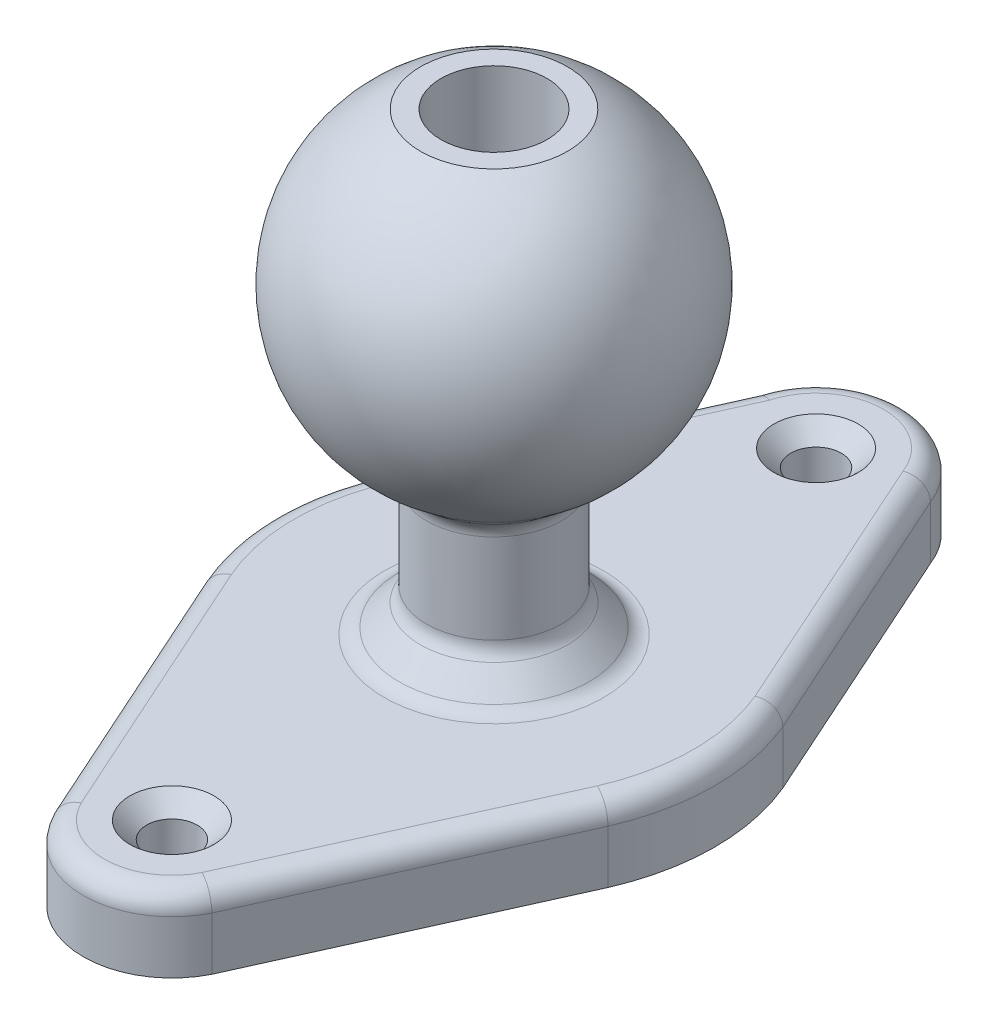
ISO-10303-21;
HEADER;
FILE_DESCRIPTION(('STEP AP214'),'2;1');
FILE_NAME('part.step','',(''),(''),'','','');
FILE_SCHEMA(('AUTOMOTIVE_DESIGN { 1 0 10303 214 1 1 1 1 }'));
ENDSEC;
DATA;
#1=APPLICATION_CONTEXT('core data for automotive mechanical design processes');
#2=APPLICATION_PROTOCOL_DEFINITION('international standard','automotive_design',2000,#1);
#3=PRODUCT_CONTEXT('',#1,'mechanical');
#4=PRODUCT('Part','Part','',(#3));
#5=PRODUCT_RELATED_PRODUCT_CATEGORY('part','',(#4));
#6=PRODUCT_DEFINITION_FORMATION('','',#4);
#7=PRODUCT_DEFINITION_CONTEXT('part definition',#1,'design');
#8=PRODUCT_DEFINITION('design','',#6,#7);
#9=PRODUCT_DEFINITION_SHAPE('','',#8);
#10=(LENGTH_UNIT() NAMED_UNIT(*) SI_UNIT(.MILLI.,.METRE.));
#11=(NAMED_UNIT(*) PLANE_ANGLE_UNIT() SI_UNIT($,.RADIAN.));
#12=(NAMED_UNIT(*) SI_UNIT($,.STERADIAN.) SOLID_ANGLE_UNIT());
#13=UNCERTAINTY_MEASURE_WITH_UNIT(LENGTH_MEASURE(1.E-05),#10,'distance_accuracy_value','');
#14=(GEOMETRIC_REPRESENTATION_CONTEXT(3) GLOBAL_UNCERTAINTY_ASSIGNED_CONTEXT((#13)) GLOBAL_UNIT_ASSIGNED_CONTEXT((#10,
#11,#12)) REPRESENTATION_CONTEXT('',''));
#15=CARTESIAN_POINT('',(0.,0.,0.));
#16=DIRECTION('',(0.,0.,1.));
#17=DIRECTION('',(1.,0.,0.));
#18=AXIS2_PLACEMENT_3D('',#15,#16,#17);
#19=CARTESIAN_POINT('',(0.,28.448,0.));
#20=DIRECTION('',(-0.683628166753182,0.,0.729830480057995));
#21=DIRECTION('',(-0.729830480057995,0.,-0.683628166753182));
#22=AXIS2_PLACEMENT_3D('',#19,#20,#21);
#23=SPHERICAL_SURFACE('',#22,12.7);
#24=CARTESIAN_POINT('',(0.,28.448,0.));
#25=DIRECTION('',(0.,1.,0.));
#26=DIRECTION('',(0.,0.,1.));
#27=AXIS2_PLACEMENT_3D('',#24,#25,#26);
#28=SPHERICAL_SURFACE('',#27,12.7);
#29=CARTESIAN_POINT('',(0.,18.1591898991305,0.));
#30=DIRECTION('',(0.,1.,0.));
#31=DIRECTION('',(0.,0.,1.));
#32=AXIS2_PLACEMENT_3D('',#29,#30,#31);
#33=CIRCLE('',#32,7.44515860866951);
#34=CARTESIAN_POINT('',(0.,18.1591898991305,7.44515860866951));
#35=VERTEX_POINT('',#34);
#36=EDGE_CURVE('E136',#35,#35,#33,.T.);
#37=ORIENTED_EDGE('',*,*,#36,.T.);
#38=EDGE_LOOP('',(#37));
#39=FACE_BOUND('',#38,.T.);
#40=CARTESIAN_POINT('',(0.,39.878,0.));
#41=DIRECTION('',(0.,1.,0.));
#42=DIRECTION('',(0.,0.,1.));
#43=AXIS2_PLACEMENT_3D('',#40,#41,#42);
#44=CIRCLE('',#43,5.53580165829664);
#45=CARTESIAN_POINT('',(0.,39.878,5.53580165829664));
#46=VERTEX_POINT('',#45);
#47=EDGE_CURVE('E247',#46,#46,#44,.F.);
#48=ORIENTED_EDGE('',*,*,#47,.T.);
#49=EDGE_LOOP('',(#48));
#50=FACE_BOUND('',#49,.T.);
#51=ADVANCED_FACE('F35',(#39,#50),#28,.T.);
#52=CARTESIAN_POINT('',(0.,5.588,0.));
#53=DIRECTION('',(0.,-1.,0.));
#54=DIRECTION('',(0.,0.,-1.));
#55=AXIS2_PLACEMENT_3D('',#52,#53,#54);
#56=PLANE('',#55);
#57=CARTESIAN_POINT('',(0.,5.588,-24.2824));
#58=DIRECTION('',(0.,-1.,0.));
#59=DIRECTION('',(0.,0.,-1.));
#60=AXIS2_PLACEMENT_3D('',#57,#58,#59);
#61=CIRCLE('',#60,3.17500000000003);
#62=CARTESIAN_POINT('',(0.,5.588,-27.4574));
#63=VERTEX_POINT('',#62);
#64=EDGE_CURVE('E43',#63,#63,#61,.T.);
#65=ORIENTED_EDGE('',*,*,#64,.T.);
#66=EDGE_LOOP('',(#65));
#67=FACE_BOUND('',#66,.T.);
#68=CARTESIAN_POINT('',(0.,5.588,24.2824));
#69=DIRECTION('',(0.,-1.,0.));
#70=DIRECTION('',(0.,0.,-1.));
#71=AXIS2_PLACEMENT_3D('',#68,#69,#70);
#72=CIRCLE('',#71,3.175);
#73=CARTESIAN_POINT('',(0.,5.588,21.1074));
#74=VERTEX_POINT('',#73);
#75=EDGE_CURVE('E678',#74,#74,#72,.T.);
#76=ORIENTED_EDGE('',*,*,#75,.T.);
#77=EDGE_LOOP('',(#76));
#78=FACE_BOUND('',#77,.T.);
#79=CARTESIAN_POINT('',(0.,5.588,0.));
#80=DIRECTION('',(0.,-1.,0.));
#81=DIRECTION('',(0.,0.,-1.));
#82=AXIS2_PLACEMENT_3D('',#79,#80,#81);
#83=CIRCLE('',#82,8.2775640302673);
#84=CARTESIAN_POINT('',(0.,5.588,-8.2775640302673));
#85=VERTEX_POINT('',#84);
#86=EDGE_CURVE('E218',#85,#85,#83,.T.);
#87=ORIENTED_EDGE('',*,*,#86,.T.);
#88=EDGE_LOOP('',(#87));
#89=FACE_BOUND('',#88,.T.);
#90=DIRECTION('',(0.410204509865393,0.,0.911993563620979));
#91=VECTOR('',#90,1.);
#92=CARTESIAN_POINT('',(-13.7241133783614,5.588,6.17295277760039));
#93=LINE('',#92,#91);
#94=CARTESIAN_POINT('',(-13.7961229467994,5.588,6.01285638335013));
#95=VERTEX_POINT('',#94);
#96=CARTESIAN_POINT('',(-4.54766749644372,5.588,26.5746289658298));
#97=VERTEX_POINT('',#96);
#98=EDGE_CURVE('E213',#95,#97,#93,.T.);
#99=ORIENTED_EDGE('',*,*,#98,.T.);
#100=CARTESIAN_POINT('',(0.,5.588,24.2824));
#101=DIRECTION('',(0.,-1.,0.));
#102=DIRECTION('',(0.,0.,-1.));
#103=AXIS2_PLACEMENT_3D('',#100,#101,#102);
#104=CIRCLE('',#103,5.0927);
#105=CARTESIAN_POINT('',(4.5476674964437,5.588,26.5746289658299));
#106=VERTEX_POINT('',#105);
#107=EDGE_CURVE('E215',#97,#106,#104,.F.);
#108=ORIENTED_EDGE('',*,*,#107,.T.);
#109=DIRECTION('',(0.410204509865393,0.,-0.911993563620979));
#110=VECTOR('',#109,1.);
#111=CARTESIAN_POINT('',(13.7241133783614,5.588,6.17295277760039));
#112=LINE('',#111,#110);
#113=CARTESIAN_POINT('',(13.7961229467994,5.588,6.01285638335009));
#114=VERTEX_POINT('',#113);
#115=EDGE_CURVE('E201',#106,#114,#112,.T.);
#116=ORIENTED_EDGE('',*,*,#115,.T.);
#117=CARTESIAN_POINT('',(0.,5.588,0.));
#118=DIRECTION('',(0.,-1.,0.));
#119=DIRECTION('',(0.,0.,-1.));
#120=AXIS2_PLACEMENT_3D('',#117,#118,#119);
#121=CIRCLE('',#120,15.0495);
#122=CARTESIAN_POINT('',(13.88885436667,5.588,-5.79544429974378));
#123=VERTEX_POINT('',#122);
#124=EDGE_CURVE('E203',#114,#123,#121,.F.);
#125=ORIENTED_EDGE('',*,*,#124,.T.);
#126=DIRECTION('',(-0.410259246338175,0.,-0.911968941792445));
#127=VECTOR('',#126,1.);
#128=CARTESIAN_POINT('',(13.7195134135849,5.588,-6.17187381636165));
#129=LINE('',#128,#127);
#130=CARTESIAN_POINT('',(4.77128554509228,5.588,-26.0629694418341));
#131=VERTEX_POINT('',#130);
#132=EDGE_CURVE('E205',#123,#131,#129,.T.);
#133=ORIENTED_EDGE('',*,*,#132,.T.);
#134=CARTESIAN_POINT('',(0.,5.588,-24.2824));
#135=DIRECTION('',(0.,-1.,0.));
#136=DIRECTION('',(0.,0.,-1.));
#137=AXIS2_PLACEMENT_3D('',#134,#135,#136);
#138=CIRCLE('',#137,5.0927);
#139=CARTESIAN_POINT('',(-4.90563269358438,5.588,-25.6500114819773));
#140=VERTEX_POINT('',#139);
#141=EDGE_CURVE('E207',#131,#140,#138,.F.);
#142=ORIENTED_EDGE('',*,*,#141,.T.);
#143=DIRECTION('',(-0.410204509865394,0.,0.911993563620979));
#144=VECTOR('',#143,1.);
#145=CARTESIAN_POINT('',(-13.6759415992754,5.588,-6.15128564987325));
#146=LINE('',#145,#144);
#147=CARTESIAN_POINT('',(-14.1976850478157,5.588,-4.99131140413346));
#148=VERTEX_POINT('',#147);
#149=EDGE_CURVE('E209',#140,#148,#146,.T.);
#150=ORIENTED_EDGE('',*,*,#149,.T.);
#151=CARTESIAN_POINT('',(0.,5.588,0.));
#152=DIRECTION('',(0.,-1.,0.));
#153=DIRECTION('',(0.,0.,-1.));
#154=AXIS2_PLACEMENT_3D('',#151,#152,#153);
#155=CIRCLE('',#154,15.0495);
#156=EDGE_CURVE('E211',#148,#95,#155,.F.);
#157=ORIENTED_EDGE('',*,*,#156,.T.);
#158=EDGE_LOOP('',(#99,#108,#116,#125,#133,#142,#150,#157));
#159=FACE_BOUND('',#158,.T.);
#160=ADVANCED_FACE('F336',(#67,#78,#89,#159),#56,.F.);
#161=CARTESIAN_POINT('',(0.,0.,0.));
#162=DIRECTION('',(0.,-1.,0.));
#163=DIRECTION('',(0.,0.,-1.));
#164=AXIS2_PLACEMENT_3D('',#161,#162,#163);
#165=PLANE('',#164);
#166=CARTESIAN_POINT('',(0.,0.,0.));
#167=DIRECTION('',(0.,-1.,0.));
#168=DIRECTION('',(0.,0.,-1.));
#169=AXIS2_PLACEMENT_3D('',#166,#167,#168);
#170=CIRCLE('',#169,1.74999999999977);
#171=CARTESIAN_POINT('',(0.,0.,-1.74999999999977));
#172=VERTEX_POINT('',#171);
#173=EDGE_CURVE('E632',#172,#172,#170,.T.);
#174=ORIENTED_EDGE('',*,*,#173,.F.);
#175=EDGE_LOOP('',(#174));
#176=FACE_BOUND('',#175,.T.);
#177=CARTESIAN_POINT('',(0.,0.,-24.2824));
#178=DIRECTION('',(0.,1.,0.));
#179=DIRECTION('',(0.,0.,1.));
#180=AXIS2_PLACEMENT_3D('',#177,#178,#179);
#181=CIRCLE('',#180,1.905);
#182=CARTESIAN_POINT('',(0.,0.,-22.3774));
#183=VERTEX_POINT('',#182);
#184=EDGE_CURVE('E153',#183,#183,#181,.T.);
#185=ORIENTED_EDGE('',*,*,#184,.T.);
#186=EDGE_LOOP('',(#185));
#187=FACE_BOUND('',#186,.T.);
#188=CARTESIAN_POINT('',(0.,0.,0.));
#189=DIRECTION('',(0.,1.,0.));
#190=DIRECTION('',(0.,0.,-1.));
#191=AXIS2_PLACEMENT_3D('',#188,#189,#190);
#192=CIRCLE('',#191,16.637);
#193=CARTESIAN_POINT('',(-15.6723500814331,0.,-5.58276024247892));
#194=VERTEX_POINT('',#193);
#195=CARTESIAN_POINT('',(-15.2476156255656,0.,6.65582352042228));
#196=VERTEX_POINT('',#195);
#197=EDGE_CURVE('E144',#194,#196,#192,.T.);
#198=ORIENTED_EDGE('',*,*,#197,.F.);
#199=DIRECTION('',(-0.410204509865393,0.,0.911993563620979));
#200=VECTOR('',#199,1.);
#201=CARTESIAN_POINT('',(-6.39926693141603,0.,-26.1992867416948));
#202=LINE('',#201,#200);
#203=CARTESIAN_POINT('',(-6.39926693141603,0.,-26.1992867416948));
#204=VERTEX_POINT('',#203);
#205=EDGE_CURVE('E173',#204,#194,#202,.T.);
#206=ORIENTED_EDGE('',*,*,#205,.F.);
#207=CARTESIAN_POINT('',(0.,0.,-24.2824));
#208=DIRECTION('',(0.,1.,0.));
#209=DIRECTION('',(0.,0.,1.));
#210=AXIS2_PLACEMENT_3D('',#207,#208,#209);
#211=CIRCLE('',#210,6.6802);
#212=CARTESIAN_POINT('',(6.23894528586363,0.,-26.67));
#213=VERTEX_POINT('',#212);
#214=EDGE_CURVE('E170',#213,#204,#211,.T.);
#215=ORIENTED_EDGE('',*,*,#214,.F.);
#216=DIRECTION('',(-0.410259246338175,0.,-0.911968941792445));
#217=VECTOR('',#216,1.);
#218=CARTESIAN_POINT('',(6.23894528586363,0.,-26.67));
#219=LINE('',#218,#217);
#220=CARTESIAN_POINT('',(15.345314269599,0.,-6.42737107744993));
#221=VERTEX_POINT('',#220);
#222=EDGE_CURVE('E167',#221,#213,#219,.T.);
#223=ORIENTED_EDGE('',*,*,#222,.F.);
#224=CARTESIAN_POINT('',(0.,0.,0.));
#225=DIRECTION('',(0.,1.,0.));
#226=DIRECTION('',(0.,0.,1.));
#227=AXIS2_PLACEMENT_3D('',#224,#225,#226);
#228=CIRCLE('',#227,16.637);
#229=CARTESIAN_POINT('',(15.2476156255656,0.,6.65582352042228));
#230=VERTEX_POINT('',#229);
#231=EDGE_CURVE('E164',#230,#221,#228,.T.);
#232=ORIENTED_EDGE('',*,*,#231,.F.);
#233=DIRECTION('',(0.410204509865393,0.,-0.911993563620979));
#234=VECTOR('',#233,1.);
#235=CARTESIAN_POINT('',(5.98203873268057,0.,27.2556616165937));
#236=LINE('',#235,#234);
#237=CARTESIAN_POINT('',(5.98203873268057,0.,27.2556616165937));
#238=VERTEX_POINT('',#237);
#239=EDGE_CURVE('E161',#238,#230,#236,.T.);
#240=ORIENTED_EDGE('',*,*,#239,.F.);
#241=CARTESIAN_POINT('',(0.,0.,24.2824));
#242=DIRECTION('',(0.,1.,0.));
#243=DIRECTION('',(0.,0.,1.));
#244=AXIS2_PLACEMENT_3D('',#241,#242,#243);
#245=CIRCLE('',#244,6.6802);
#246=CARTESIAN_POINT('',(-5.98203873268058,0.,27.2556616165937));
#247=VERTEX_POINT('',#246);
#248=EDGE_CURVE('E147',#247,#238,#245,.T.);
#249=ORIENTED_EDGE('',*,*,#248,.F.);
#250=DIRECTION('',(0.410204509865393,0.,0.911993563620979));
#251=VECTOR('',#250,1.);
#252=CARTESIAN_POINT('',(-15.2476156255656,0.,6.65582352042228));
#253=LINE('',#252,#251);
#254=EDGE_CURVE('E129',#196,#247,#253,.T.);
#255=ORIENTED_EDGE('',*,*,#254,.F.);
#256=EDGE_LOOP('',(#198,#206,#215,#223,#232,#240,#249,#255));
#257=FACE_BOUND('',#256,.T.);
#258=CARTESIAN_POINT('',(0.,0.,24.2824));
#259=DIRECTION('',(0.,1.,0.));
#260=DIRECTION('',(0.,0.,1.));
#261=AXIS2_PLACEMENT_3D('',#258,#259,#260);
#262=CIRCLE('',#261,1.905);
#263=CARTESIAN_POINT('',(0.,0.,26.1874));
#264=VERTEX_POINT('',#263);
#265=EDGE_CURVE('E156',#264,#264,#262,.T.);
#266=ORIENTED_EDGE('',*,*,#265,.T.);
#267=EDGE_LOOP('',(#266));
#268=FACE_BOUND('',#267,.T.);
#269=ADVANCED_FACE('F141',(#176,#187,#257,#268),#165,.T.);
#270=CARTESIAN_POINT('',(0.,5.588,0.));
#271=DIRECTION('',(0.,-1.,0.));
#272=DIRECTION('',(0.,0.,-1.));
#273=AXIS2_PLACEMENT_3D('',#270,#271,#272);
#274=CYLINDRICAL_SURFACE('',#273,16.637);
#275=DIRECTION('',(0.,-1.,0.));
#276=VECTOR('',#275,1.);
#277=CARTESIAN_POINT('',(-15.2476156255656,5.588,6.65582352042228));
#278=LINE('',#277,#276);
#279=CARTESIAN_POINT('',(-15.2476156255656,4.0005,6.65582352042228));
#280=VERTEX_POINT('',#279);
#281=EDGE_CURVE('E125',#280,#196,#278,.T.);
#282=ORIENTED_EDGE('',*,*,#281,.F.);
#283=CARTESIAN_POINT('',(0.,4.0005,0.));
#284=DIRECTION('',(0.,-1.,0.));
#285=DIRECTION('',(0.,0.,-1.));
#286=AXIS2_PLACEMENT_3D('',#283,#284,#285);
#287=CIRCLE('',#286,16.637);
#288=CARTESIAN_POINT('',(-15.6723500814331,4.0005,-5.58276024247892));
#289=VERTEX_POINT('',#288);
#290=EDGE_CURVE('E228',#280,#289,#287,.T.);
#291=ORIENTED_EDGE('',*,*,#290,.T.);
#292=DIRECTION('',(0.,-1.,0.));
#293=VECTOR('',#292,1.);
#294=CARTESIAN_POINT('',(-15.6723500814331,5.588,-5.58276024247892));
#295=LINE('',#294,#293);
#296=EDGE_CURVE('E151',#289,#194,#295,.T.);
#297=ORIENTED_EDGE('',*,*,#296,.T.);
#298=ORIENTED_EDGE('',*,*,#197,.T.);
#299=EDGE_LOOP('',(#282,#291,#297,#298));
#300=FACE_BOUND('',#299,.T.);
#301=ADVANCED_FACE('F149',(#300),#274,.T.);
#302=CARTESIAN_POINT('',(-15.2476156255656,5.588,6.65582352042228));
#303=DIRECTION('',(0.911993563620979,0.,-0.410204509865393));
#304=DIRECTION('',(-0.410204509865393,0.,-0.911993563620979));
#305=AXIS2_PLACEMENT_3D('',#302,#303,#304);
#306=PLANE('',#305);
#307=DIRECTION('',(0.,-1.,0.));
#308=VECTOR('',#307,1.);
#309=CARTESIAN_POINT('',(-5.98203873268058,5.588,27.2556616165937));
#310=LINE('',#309,#308);
#311=CARTESIAN_POINT('',(-5.98203873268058,4.0005,27.2556616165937));
#312=VERTEX_POINT('',#311);
#313=EDGE_CURVE('E137',#312,#247,#310,.T.);
#314=ORIENTED_EDGE('',*,*,#313,.F.);
#315=DIRECTION('',(0.410204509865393,0.,0.911993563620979));
#316=VECTOR('',#315,1.);
#317=CARTESIAN_POINT('',(-15.2476156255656,4.0005,6.65582352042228));
#318=LINE('',#317,#316);
#319=EDGE_CURVE('E132',#312,#280,#318,.F.);
#320=ORIENTED_EDGE('',*,*,#319,.T.);
#321=ORIENTED_EDGE('',*,*,#281,.T.);
#322=ORIENTED_EDGE('',*,*,#254,.T.);
#323=EDGE_LOOP('',(#314,#320,#321,#322));
#324=FACE_BOUND('',#323,.T.);
#325=ADVANCED_FACE('F128',(#324),#306,.F.);
#326=CARTESIAN_POINT('',(0.,5.588,24.2824));
#327=DIRECTION('',(0.,-1.,0.));
#328=DIRECTION('',(0.,0.,-1.));
#329=AXIS2_PLACEMENT_3D('',#326,#327,#328);
#330=CYLINDRICAL_SURFACE('',#329,6.6802);
#331=DIRECTION('',(0.,-1.,0.));
#332=VECTOR('',#331,1.);
#333=CARTESIAN_POINT('',(5.98203873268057,5.588,27.2556616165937));
#334=LINE('',#333,#332);
#335=CARTESIAN_POINT('',(5.98203873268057,4.0005,27.2556616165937));
#336=VERTEX_POINT('',#335);
#337=EDGE_CURVE('E184',#336,#238,#334,.T.);
#338=ORIENTED_EDGE('',*,*,#337,.F.);
#339=CARTESIAN_POINT('',(0.,4.0005,24.2824));
#340=DIRECTION('',(0.,-1.,0.));
#341=DIRECTION('',(0.,0.,-1.));
#342=AXIS2_PLACEMENT_3D('',#339,#340,#341);
#343=CIRCLE('',#342,6.6802);
#344=EDGE_CURVE('E224',#336,#312,#343,.T.);
#345=ORIENTED_EDGE('',*,*,#344,.T.);
#346=ORIENTED_EDGE('',*,*,#313,.T.);
#347=ORIENTED_EDGE('',*,*,#248,.T.);
#348=EDGE_LOOP('',(#338,#345,#346,#347));
#349=FACE_BOUND('',#348,.T.);
#350=ADVANCED_FACE('F382',(#349),#330,.T.);
#351=CARTESIAN_POINT('',(5.98203873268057,5.588,27.2556616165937));
#352=DIRECTION('',(-0.911993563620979,0.,-0.410204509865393));
#353=DIRECTION('',(-0.410204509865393,0.,0.911993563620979));
#354=AXIS2_PLACEMENT_3D('',#351,#352,#353);
#355=PLANE('',#354);
#356=DIRECTION('',(0.,-1.,0.));
#357=VECTOR('',#356,1.);
#358=CARTESIAN_POINT('',(15.2476156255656,5.588,6.65582352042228));
#359=LINE('',#358,#357);
#360=CARTESIAN_POINT('',(15.2476156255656,4.0005,6.65582352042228));
#361=VERTEX_POINT('',#360);
#362=EDGE_CURVE('E182',#361,#230,#359,.T.);
#363=ORIENTED_EDGE('',*,*,#362,.F.);
#364=DIRECTION('',(0.410204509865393,0.,-0.911993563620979));
#365=VECTOR('',#364,1.);
#366=CARTESIAN_POINT('',(5.98203873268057,4.0005,27.2556616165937));
#367=LINE('',#366,#365);
#368=EDGE_CURVE('E236',#361,#336,#367,.F.);
#369=ORIENTED_EDGE('',*,*,#368,.T.);
#370=ORIENTED_EDGE('',*,*,#337,.T.);
#371=ORIENTED_EDGE('',*,*,#239,.T.);
#372=EDGE_LOOP('',(#363,#369,#370,#371));
#373=FACE_BOUND('',#372,.T.);
#374=ADVANCED_FACE('F379',(#373),#355,.F.);
#375=CARTESIAN_POINT('',(0.,5.588,0.));
#376=DIRECTION('',(0.,-1.,0.));
#377=DIRECTION('',(0.,0.,-1.));
#378=AXIS2_PLACEMENT_3D('',#375,#376,#377);
#379=CYLINDRICAL_SURFACE('',#378,16.637);
#380=DIRECTION('',(0.,-1.,0.));
#381=VECTOR('',#380,1.);
#382=CARTESIAN_POINT('',(15.345314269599,5.588,-6.42737107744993));
#383=LINE('',#382,#381);
#384=CARTESIAN_POINT('',(15.345314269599,4.0005,-6.42737107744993));
#385=VERTEX_POINT('',#384);
#386=EDGE_CURVE('E180',#385,#221,#383,.T.);
#387=ORIENTED_EDGE('',*,*,#386,.F.);
#388=CARTESIAN_POINT('',(0.,4.0005,0.));
#389=DIRECTION('',(0.,-1.,0.));
#390=DIRECTION('',(0.,0.,-1.));
#391=AXIS2_PLACEMENT_3D('',#388,#389,#390);
#392=CIRCLE('',#391,16.637);
#393=EDGE_CURVE('E50',#385,#361,#392,.T.);
#394=ORIENTED_EDGE('',*,*,#393,.T.);
#395=ORIENTED_EDGE('',*,*,#362,.T.);
#396=ORIENTED_EDGE('',*,*,#231,.T.);
#397=EDGE_LOOP('',(#387,#394,#395,#396));
#398=FACE_BOUND('',#397,.T.);
#399=ADVANCED_FACE('F376',(#398),#379,.T.);
#400=CARTESIAN_POINT('',(6.23894528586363,5.588,-26.67));
#401=DIRECTION('',(-0.911968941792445,0.,0.410259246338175));
#402=DIRECTION('',(0.410259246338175,0.,0.911968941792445));
#403=AXIS2_PLACEMENT_3D('',#400,#401,#402);
#404=PLANE('',#403);
#405=DIRECTION('',(0.,-1.,0.));
#406=VECTOR('',#405,1.);
#407=CARTESIAN_POINT('',(6.23894528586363,5.588,-26.67));
#408=LINE('',#407,#406);
#409=CARTESIAN_POINT('',(6.23894528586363,4.0005,-26.67));
#410=VERTEX_POINT('',#409);
#411=EDGE_CURVE('E178',#410,#213,#408,.T.);
#412=ORIENTED_EDGE('',*,*,#411,.F.);
#413=DIRECTION('',(-0.410259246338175,0.,-0.911968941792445));
#414=VECTOR('',#413,1.);
#415=CARTESIAN_POINT('',(6.23894528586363,4.0005,-26.67));
#416=LINE('',#415,#414);
#417=EDGE_CURVE('E58',#410,#385,#416,.F.);
#418=ORIENTED_EDGE('',*,*,#417,.T.);
#419=ORIENTED_EDGE('',*,*,#386,.T.);
#420=ORIENTED_EDGE('',*,*,#222,.T.);
#421=EDGE_LOOP('',(#412,#418,#419,#420));
#422=FACE_BOUND('',#421,.T.);
#423=ADVANCED_FACE('F372',(#422),#404,.F.);
#424=CARTESIAN_POINT('',(0.,5.588,-24.2824));
#425=DIRECTION('',(0.,-1.,0.));
#426=DIRECTION('',(0.,0.,-1.));
#427=AXIS2_PLACEMENT_3D('',#424,#425,#426);
#428=CYLINDRICAL_SURFACE('',#427,6.6802);
#429=DIRECTION('',(0.,-1.,0.));
#430=VECTOR('',#429,1.);
#431=CARTESIAN_POINT('',(-6.39926693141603,5.588,-26.1992867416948));
#432=LINE('',#431,#430);
#433=CARTESIAN_POINT('',(-6.39926693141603,4.0005,-26.1992867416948));
#434=VERTEX_POINT('',#433);
#435=EDGE_CURVE('E176',#434,#204,#432,.T.);
#436=ORIENTED_EDGE('',*,*,#435,.F.);
#437=CARTESIAN_POINT('',(0.,4.0005,-24.2824));
#438=DIRECTION('',(0.,-1.,0.));
#439=DIRECTION('',(0.,0.,-1.));
#440=AXIS2_PLACEMENT_3D('',#437,#438,#439);
#441=CIRCLE('',#440,6.6802);
#442=EDGE_CURVE('E232',#434,#410,#441,.T.);
#443=ORIENTED_EDGE('',*,*,#442,.T.);
#444=ORIENTED_EDGE('',*,*,#411,.T.);
#445=ORIENTED_EDGE('',*,*,#214,.T.);
#446=EDGE_LOOP('',(#436,#443,#444,#445));
#447=FACE_BOUND('',#446,.T.);
#448=ADVANCED_FACE('F368',(#447),#428,.T.);
#449=CARTESIAN_POINT('',(-6.39926693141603,5.588,-26.1992867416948));
#450=DIRECTION('',(0.911993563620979,0.,0.410204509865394));
#451=DIRECTION('',(0.410204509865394,0.,-0.911993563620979));
#452=AXIS2_PLACEMENT_3D('',#449,#450,#451);
#453=PLANE('',#452);
#454=ORIENTED_EDGE('',*,*,#296,.F.);
#455=DIRECTION('',(-0.410204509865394,0.,0.911993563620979));
#456=VECTOR('',#455,1.);
#457=CARTESIAN_POINT('',(-6.39926693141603,4.0005,-26.1992867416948));
#458=LINE('',#457,#456);
#459=EDGE_CURVE('E230',#289,#434,#458,.F.);
#460=ORIENTED_EDGE('',*,*,#459,.T.);
#461=ORIENTED_EDGE('',*,*,#435,.T.);
#462=ORIENTED_EDGE('',*,*,#205,.T.);
#463=EDGE_LOOP('',(#454,#460,#461,#462));
#464=FACE_BOUND('',#463,.T.);
#465=ADVANCED_FACE('F360',(#464),#453,.F.);
#466=CARTESIAN_POINT('',(0.,5.588,-24.2824));
#467=DIRECTION('',(0.,-1.,0.));
#468=DIRECTION('',(0.,0.,-1.));
#469=AXIS2_PLACEMENT_3D('',#466,#467,#468);
#470=CYLINDRICAL_SURFACE('',#469,1.905);
#471=CARTESIAN_POINT('',(0.,4.31799999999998,-24.2824));
#472=DIRECTION('',(0.,-1.,0.));
#473=DIRECTION('',(0.,0.,-1.));
#474=AXIS2_PLACEMENT_3D('',#471,#472,#473);
#475=CIRCLE('',#474,1.905);
#476=CARTESIAN_POINT('',(0.,4.31799999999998,-26.1874));
#477=VERTEX_POINT('',#476);
#478=EDGE_CURVE('E238',#477,#477,#475,.F.);
#479=ORIENTED_EDGE('',*,*,#478,.T.);
#480=EDGE_LOOP('',(#479));
#481=FACE_BOUND('',#480,.T.);
#482=ORIENTED_EDGE('',*,*,#184,.F.);
#483=EDGE_LOOP('',(#482));
#484=FACE_BOUND('',#483,.T.);
#485=ADVANCED_FACE('F357',(#481,#484),#470,.F.);
#486=CARTESIAN_POINT('',(0.,5.588,24.2824));
#487=DIRECTION('',(0.,-1.,0.));
#488=DIRECTION('',(0.,0.,-1.));
#489=AXIS2_PLACEMENT_3D('',#486,#487,#488);
#490=CYLINDRICAL_SURFACE('',#489,1.905);
#491=CARTESIAN_POINT('',(0.,4.318,24.2824));
#492=DIRECTION('',(0.,-1.,0.));
#493=DIRECTION('',(0.,0.,-1.));
#494=AXIS2_PLACEMENT_3D('',#491,#492,#493);
#495=CIRCLE('',#494,1.905);
#496=CARTESIAN_POINT('',(0.,4.318,22.3774));
#497=VERTEX_POINT('',#496);
#498=EDGE_CURVE('E11',#497,#497,#495,.F.);
#499=ORIENTED_EDGE('',*,*,#498,.T.);
#500=EDGE_LOOP('',(#499));
#501=FACE_BOUND('',#500,.T.);
#502=ORIENTED_EDGE('',*,*,#265,.F.);
#503=EDGE_LOOP('',(#502));
#504=FACE_BOUND('',#503,.T.);
#505=ADVANCED_FACE('F353',(#501,#504),#490,.F.);
#506=CARTESIAN_POINT('',(0.,28.448,0.));
#507=DIRECTION('',(0.,-1.,0.));
#508=DIRECTION('',(0.,0.,-1.));
#509=AXIS2_PLACEMENT_3D('',#506,#507,#508);
#510=CYLINDRICAL_SURFACE('',#509,5.08);
#511=CARTESIAN_POINT('',(0.,8.78556403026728,0.));
#512=DIRECTION('',(0.,1.,0.));
#513=DIRECTION('',(0.,0.,1.));
#514=AXIS2_PLACEMENT_3D('',#511,#512,#513);
#515=CIRCLE('',#514,5.08);
#516=CARTESIAN_POINT('',(0.,8.78556403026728,5.08));
#517=VERTEX_POINT('',#516);
#518=EDGE_CURVE('E192',#517,#517,#515,.T.);
#519=ORIENTED_EDGE('',*,*,#518,.T.);
#520=EDGE_LOOP('',(#519));
#521=FACE_BOUND('',#520,.T.);
#522=CARTESIAN_POINT('',(0.,15.5254175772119,0.));
#523=DIRECTION('',(0.,-1.,0.));
#524=DIRECTION('',(0.,0.,-1.));
#525=AXIS2_PLACEMENT_3D('',#522,#523,#524);
#526=CIRCLE('',#525,5.08);
#527=CARTESIAN_POINT('',(0.,15.5254175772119,-5.08));
#528=VERTEX_POINT('',#527);
#529=EDGE_CURVE('E189',#528,#528,#526,.T.);
#530=ORIENTED_EDGE('',*,*,#529,.T.);
#531=EDGE_LOOP('',(#530));
#532=FACE_BOUND('',#531,.T.);
#533=ADVANCED_FACE('F349',(#521,#532),#510,.T.);
#534=CARTESIAN_POINT('',(0.,18.1591898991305,0.));
#535=DIRECTION('',(0.,1.,0.));
#536=DIRECTION('',(0.,0.,1.));
#537=AXIS2_PLACEMENT_3D('',#534,#535,#536);
#538=CONICAL_SURFACE('',#537,7.4451586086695,0.903474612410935);
#539=CARTESIAN_POINT('',(0.,16.7723703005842,0.));
#540=DIRECTION('',(0.,-1.,0.));
#541=DIRECTION('',(0.,0.,-1.));
#542=AXIS2_PLACEMENT_3D('',#539,#540,#541);
#543=CIRCLE('',#542,5.68502091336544);
#544=CARTESIAN_POINT('',(0.,16.7723703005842,-5.68502091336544));
#545=VERTEX_POINT('',#544);
#546=EDGE_CURVE('E221',#545,#545,#543,.F.);
#547=ORIENTED_EDGE('',*,*,#546,.T.);
#548=EDGE_LOOP('',(#547));
#549=FACE_BOUND('',#548,.T.);
#550=ORIENTED_EDGE('',*,*,#36,.F.);
#551=EDGE_LOOP('',(#550));
#552=FACE_BOUND('',#551,.T.);
#553=ADVANCED_FACE('F352',(#549,#552),#538,.T.);
#554=CARTESIAN_POINT('',(0.,5.588,0.));
#555=DIRECTION('',(0.,-1.,0.));
#556=DIRECTION('',(0.,0.,-1.));
#557=AXIS2_PLACEMENT_3D('',#554,#555,#556);
#558=CONICAL_SURFACE('',#557,7.62000000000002,0.785398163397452);
#559=CARTESIAN_POINT('',(0.,7.66303201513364,0.));
#560=DIRECTION('',(0.,1.,0.));
#561=DIRECTION('',(0.,0.,1.));
#562=AXIS2_PLACEMENT_3D('',#559,#560,#561);
#563=CIRCLE('',#562,5.54496798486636);
#564=CARTESIAN_POINT('',(0.,7.66303201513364,5.54496798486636));
#565=VERTEX_POINT('',#564);
#566=EDGE_CURVE('E198',#565,#565,#563,.F.);
#567=ORIENTED_EDGE('',*,*,#566,.T.);
#568=EDGE_LOOP('',(#567));
#569=FACE_BOUND('',#568,.T.);
#570=CARTESIAN_POINT('',(0.,6.05296798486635,0.));
#571=DIRECTION('',(0.,-1.,0.));
#572=DIRECTION('',(0.,0.,-1.));
#573=AXIS2_PLACEMENT_3D('',#570,#571,#572);
#574=CIRCLE('',#573,7.15503201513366);
#575=CARTESIAN_POINT('',(0.,6.05296798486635,-7.15503201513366));
#576=VERTEX_POINT('',#575);
#577=EDGE_CURVE('E195',#576,#576,#574,.F.);
#578=ORIENTED_EDGE('',*,*,#577,.T.);
#579=EDGE_LOOP('',(#578));
#580=FACE_BOUND('',#579,.T.);
#581=ADVANCED_FACE('F393',(#569,#580),#558,.T.);
#582=CARTESIAN_POINT('',(0.,8.78556403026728,0.));
#583=DIRECTION('',(0.,1.,0.));
#584=DIRECTION('',(0.,0.,1.));
#585=AXIS2_PLACEMENT_3D('',#582,#583,#584);
#586=TOROIDAL_SURFACE('',#585,6.6675,1.5875);
#587=ORIENTED_EDGE('',*,*,#566,.F.);
#588=EDGE_LOOP('',(#587));
#589=FACE_BOUND('',#588,.T.);
#590=ORIENTED_EDGE('',*,*,#518,.F.);
#591=EDGE_LOOP('',(#590));
#592=FACE_BOUND('',#591,.T.);
#593=ADVANCED_FACE('F397',(#589,#592),#586,.F.);
#594=CARTESIAN_POINT('',(0.,7.1755,0.));
#595=DIRECTION('',(0.,-1.,0.));
#596=DIRECTION('',(0.,0.,-1.));
#597=AXIS2_PLACEMENT_3D('',#594,#595,#596);
#598=TOROIDAL_SURFACE('',#597,8.2775640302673,1.5875);
#599=ORIENTED_EDGE('',*,*,#577,.F.);
#600=EDGE_LOOP('',(#599));
#601=FACE_BOUND('',#600,.T.);
#602=ORIENTED_EDGE('',*,*,#86,.F.);
#603=EDGE_LOOP('',(#602));
#604=FACE_BOUND('',#603,.T.);
#605=ADVANCED_FACE('F401',(#601,#604),#598,.F.);
#606=CARTESIAN_POINT('',(0.,15.5254175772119,0.));
#607=DIRECTION('',(0.,-1.,0.));
#608=DIRECTION('',(0.,0.,-1.));
#609=AXIS2_PLACEMENT_3D('',#606,#607,#608);
#610=TOROIDAL_SURFACE('',#609,6.6675,1.5875);
#611=ORIENTED_EDGE('',*,*,#546,.F.);
#612=EDGE_LOOP('',(#611));
#613=FACE_BOUND('',#612,.T.);
#614=ORIENTED_EDGE('',*,*,#529,.F.);
#615=EDGE_LOOP('',(#614));
#616=FACE_BOUND('',#615,.T.);
#617=ADVANCED_FACE('F318',(#613,#616),#610,.F.);
#618=CARTESIAN_POINT('',(0.,4.0005,-24.2824));
#619=DIRECTION('',(0.,-1.,0.));
#620=DIRECTION('',(0.,0.,-1.));
#621=AXIS2_PLACEMENT_3D('',#618,#619,#620);
#622=TOROIDAL_SURFACE('',#621,5.0927,1.5875);
#623=CARTESIAN_POINT('',(6.23894528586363,4.0005,-26.67));
#624=CARTESIAN_POINT('',(6.23894500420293,4.04514859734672,-26.6699999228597));
#625=CARTESIAN_POINT('',(6.23720426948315,4.08977579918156,-26.6692759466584));
#626=CARTESIAN_POINT('',(6.23025972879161,4.17871079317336,-26.6663879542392));
#627=CARTESIAN_POINT('',(6.22505609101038,4.22301860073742,-26.6642240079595));
#628=CARTESIAN_POINT('',(6.20429936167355,4.35491449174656,-26.6555929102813));
#629=CARTESIAN_POINT('',(6.18360032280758,4.44161888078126,-26.6469864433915));
#630=CARTESIAN_POINT('',(6.12905325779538,4.61003037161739,-26.6243139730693));
#631=CARTESIAN_POINT('',(6.09519900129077,4.69173508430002,-26.6102453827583));
#632=CARTESIAN_POINT('',(6.01530620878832,4.84782395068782,-26.5770606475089));
#633=CARTESIAN_POINT('',(5.96927055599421,4.92220983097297,-26.5579456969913));
#634=CARTESIAN_POINT('',(5.86631033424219,5.06156675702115,-26.515220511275));
#635=CARTESIAN_POINT('',(5.80938453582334,5.12653673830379,-26.4916097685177));
#636=CARTESIAN_POINT('',(5.68623289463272,5.24523680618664,-26.4405688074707));
#637=CARTESIAN_POINT('',(5.62000381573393,5.29896296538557,-26.41313726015));
#638=CARTESIAN_POINT('',(5.48009951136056,5.39365572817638,-26.3552404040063));
#639=CARTESIAN_POINT('',(5.40641918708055,5.4346135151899,-26.3247730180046));
#640=CARTESIAN_POINT('',(5.25376176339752,5.5025326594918,-26.2617108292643));
#641=CARTESIAN_POINT('',(5.17478970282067,5.52950712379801,-26.2291180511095));
#642=CARTESIAN_POINT('',(5.04603030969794,5.56090290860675,-26.1760360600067));
#643=CARTESIAN_POINT('',(4.99718479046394,5.57002899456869,-26.1559121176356));
#644=CARTESIAN_POINT('',(4.89892788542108,5.5828969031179,-26.1154592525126));
#645=CARTESIAN_POINT('',(4.84951744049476,5.58664664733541,-26.0951306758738));
#646=CARTESIAN_POINT('',(4.79048259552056,5.58789855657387,-26.0708601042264));
#647=CARTESIAN_POINT('',(4.78088349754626,5.58800027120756,-26.066914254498));
#648=CARTESIAN_POINT('',(4.77128554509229,5.588,-26.0629694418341));
#649=B_SPLINE_CURVE_WITH_KNOTS('',3,(#623,#624,#625,#626,#627,#628,#629,#630,#631,#632,#633,
#634,#635,#636,#637,#638,#639,#640,#641,#642,#643,#644,#645,#646,#647,#648),.UNSPECIFIED.,.F.,
.F.,(4,2,2,2,2,2,2,2,2,2,2,2,4),(0.,0.133863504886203,0.267720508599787,0.535008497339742,
0.802423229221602,1.06977472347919,1.33715641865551,1.60463135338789,1.87229057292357,
2.13969845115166,2.30029934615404,2.46066336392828,2.49179792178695),.UNSPECIFIED.);
#650=EDGE_CURVE('E304',#410,#131,#649,.T.);
#651=ORIENTED_EDGE('',*,*,#650,.F.);
#652=ORIENTED_EDGE('',*,*,#442,.F.);
#653=CARTESIAN_POINT('',(-6.39926693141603,4.0005,-26.1992867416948));
#654=CARTESIAN_POINT('',(-6.39926666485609,4.04508956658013,-26.1992867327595));
#655=CARTESIAN_POINT('',(-6.39750171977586,4.08965774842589,-26.1986286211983));
#656=CARTESIAN_POINT('',(-6.39046072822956,4.17847472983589,-26.1960037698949));
#657=CARTESIAN_POINT('',(-6.38518486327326,4.22272354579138,-26.1940370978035));
#658=CARTESIAN_POINT('',(-6.36414101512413,4.35443891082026,-26.1861940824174));
#659=CARTESIAN_POINT('',(-6.34315663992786,4.44102234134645,-26.1783746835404));
#660=CARTESIAN_POINT('',(-6.28786177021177,4.60919639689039,-26.1577875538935));
#661=CARTESIAN_POINT('',(-6.25354518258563,4.69078471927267,-26.145017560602));
#662=CARTESIAN_POINT('',(-6.17256618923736,4.84665720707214,-26.1149190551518));
#663=CARTESIAN_POINT('',(-6.12590649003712,4.92094296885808,-26.097591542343));
#664=CARTESIAN_POINT('',(-6.02151751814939,5.06017928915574,-26.0588844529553));
#665=CARTESIAN_POINT('',(-5.96377901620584,5.12512198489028,-26.0375014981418));
#666=CARTESIAN_POINT('',(-5.83886671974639,5.24379677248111,-25.9913267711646));
#667=CARTESIAN_POINT('',(-5.77168981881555,5.2975251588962,-25.9665338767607));
#668=CARTESIAN_POINT('',(-5.62965615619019,5.392349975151,-25.9142274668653));
#669=CARTESIAN_POINT('',(-5.55478190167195,5.43341674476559,-25.8867077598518));
#670=CARTESIAN_POINT('',(-5.39961598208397,5.50157892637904,-25.829819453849));
#671=CARTESIAN_POINT('',(-5.31932880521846,5.52868575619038,-25.8004523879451));
#672=CARTESIAN_POINT('',(-5.18623814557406,5.56083792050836,-25.7519060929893));
#673=CARTESIAN_POINT('',(-5.13435815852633,5.57034110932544,-25.7330142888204));
#674=CARTESIAN_POINT('',(-5.02997651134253,5.58349133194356,-25.6950739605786));
#675=CARTESIAN_POINT('',(-4.97747596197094,5.5871475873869,-25.6760257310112));
#676=CARTESIAN_POINT('',(-4.91852041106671,5.58795597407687,-25.6546767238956));
#677=CARTESIAN_POINT('',(-4.91207632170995,5.5880001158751,-25.6523437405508));
#678=CARTESIAN_POINT('',(-4.90563269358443,5.588,-25.6500114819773));
#679=B_SPLINE_CURVE_WITH_KNOTS('',3,(#653,#654,#655,#656,#657,#658,#659,#660,#661,#662,#663,
#664,#665,#666,#667,#668,#669,#670,#671,#672,#673,#674,#675,#676,#677,#678),.UNSPECIFIED.,.F.,
.F.,(4,2,2,2,2,2,2,2,2,2,2,2,4),(0.,0.133686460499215,0.267366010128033,0.534286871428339,
0.801329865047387,1.06831435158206,1.33552222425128,1.60281824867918,1.87073574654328,
2.13843376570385,2.30624212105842,2.4737855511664,2.49434550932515),.UNSPECIFIED.);
#680=EDGE_CURVE('E310',#140,#434,#679,.F.);
#681=ORIENTED_EDGE('',*,*,#680,.F.);
#682=ORIENTED_EDGE('',*,*,#141,.F.);
#683=EDGE_LOOP('',(#651,#652,#681,#682));
#684=FACE_BOUND('',#683,.T.);
#685=ADVANCED_FACE('F315',(#684),#622,.T.);
#686=CARTESIAN_POINT('',(-13.6759415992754,4.0005,-6.15128564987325));
#687=DIRECTION('',(-0.410204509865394,0.,0.911993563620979));
#688=DIRECTION('',(0.911993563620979,0.,0.410204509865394));
#689=AXIS2_PLACEMENT_3D('',#686,#687,#688);
#690=CYLINDRICAL_SURFACE('',#689,1.5875);
#691=ORIENTED_EDGE('',*,*,#680,.T.);
#692=ORIENTED_EDGE('',*,*,#459,.F.);
#693=CARTESIAN_POINT('',(-15.6723500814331,4.0005,-5.58276024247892));
#694=CARTESIAN_POINT('',(-15.6723498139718,4.04513574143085,-5.58276015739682));
#695=CARTESIAN_POINT('',(-15.6706010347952,4.08975008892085,-5.58205669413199));
#696=CARTESIAN_POINT('',(-15.6636245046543,4.17865936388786,-5.5792504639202));
#697=CARTESIAN_POINT('',(-15.6583969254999,4.22295430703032,-5.57714776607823));
#698=CARTESIAN_POINT('',(-15.6375451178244,4.35481064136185,-5.56876086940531));
#699=CARTESIAN_POINT('',(-15.6167516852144,4.44148844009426,-5.56039781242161));
#700=CARTESIAN_POINT('',(-15.5619589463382,4.60984763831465,-5.5383646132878));
#701=CARTESIAN_POINT('',(-15.5279534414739,4.69152667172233,-5.52469198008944));
#702=CARTESIAN_POINT('',(-15.4477090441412,4.84756805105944,-5.49243667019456));
#703=CARTESIAN_POINT('',(-15.4014729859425,4.9219320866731,-5.47385513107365));
#704=CARTESIAN_POINT('',(-15.2980629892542,5.06126494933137,-5.43231024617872));
#705=CARTESIAN_POINT('',(-15.2408858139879,5.12623098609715,-5.40934560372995));
#706=CARTESIAN_POINT('',(-15.1171996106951,5.24492940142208,-5.35968802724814));
#707=CARTESIAN_POINT('',(-15.050687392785,5.29865792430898,-5.33299381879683));
#708=CARTESIAN_POINT('',(-14.9101696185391,5.39338341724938,-5.27662344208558));
#709=CARTESIAN_POINT('',(-14.8361562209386,5.43436687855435,-5.24694415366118));
#710=CARTESIAN_POINT('',(-14.6828168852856,5.50234153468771,-5.18548579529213));
#711=CARTESIAN_POINT('',(-14.6034958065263,5.52934533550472,-5.15370864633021));
#712=CARTESIAN_POINT('',(-14.4735165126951,5.56095100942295,-5.10166450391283));
#713=CARTESIAN_POINT('',(-14.4237868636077,5.57018401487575,-5.08175878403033));
#714=CARTESIAN_POINT('',(-14.3237550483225,5.5831186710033,-5.04173123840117));
#715=CARTESIAN_POINT('',(-14.2734538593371,5.58682864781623,-5.02160978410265));
#716=CARTESIAN_POINT('',(-14.2146525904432,5.58792142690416,-4.99809593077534));
#717=CARTESIAN_POINT('',(-14.20616831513,5.58800020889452,-4.9947033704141));
#718=CARTESIAN_POINT('',(-14.1976850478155,5.588,-4.99131140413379));
#719=B_SPLINE_CURVE_WITH_KNOTS('',3,(#693,#694,#695,#696,#697,#698,#699,#700,#701,#702,#703,
#704,#705,#706,#707,#708,#709,#710,#711,#712,#713,#714,#715,#716,#717,#718),.UNSPECIFIED.,.F.,
.F.,(4,2,2,2,2,2,2,2,2,2,2,2,4),(0.,0.13382494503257,0.267643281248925,0.53485078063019,
0.802183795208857,1.06945491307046,1.33680522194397,1.60424711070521,1.87197150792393,
2.13945406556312,2.30227836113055,2.46485694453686,2.49226863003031),.UNSPECIFIED.);
#720=EDGE_CURVE('E290',#148,#289,#719,.F.);
#721=ORIENTED_EDGE('',*,*,#720,.F.);
#722=ORIENTED_EDGE('',*,*,#149,.F.);
#723=EDGE_LOOP('',(#691,#692,#721,#722));
#724=FACE_BOUND('',#723,.T.);
#725=ADVANCED_FACE('F299',(#724),#690,.T.);
#726=CARTESIAN_POINT('',(13.7195134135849,4.0005,-6.17187381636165));
#727=DIRECTION('',(-0.410259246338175,0.,-0.911968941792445));
#728=DIRECTION('',(-0.911968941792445,0.,0.410259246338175));
#729=AXIS2_PLACEMENT_3D('',#726,#727,#728);
#730=CYLINDRICAL_SURFACE('',#729,1.5875);
#731=ORIENTED_EDGE('',*,*,#650,.T.);
#732=ORIENTED_EDGE('',*,*,#132,.F.);
#733=CARTESIAN_POINT('',(15.345314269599,4.0005,-6.42737107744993));
#734=CARTESIAN_POINT('',(15.345313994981,4.04515950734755,-6.42737096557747));
#735=CARTESIAN_POINT('',(15.3435844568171,4.08979761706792,-6.42661987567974));
#736=CARTESIAN_POINT('',(15.3366846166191,4.17875442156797,-6.42362351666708));
#737=CARTESIAN_POINT('',(15.3315144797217,4.22307313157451,-6.42137831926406));
#738=CARTESIAN_POINT('',(15.3108913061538,4.35500262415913,-6.41242256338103));
#739=CARTESIAN_POINT('',(15.2903253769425,4.44172959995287,-6.40349178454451));
#740=CARTESIAN_POINT('',(15.2361299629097,4.61018554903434,-6.37995876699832));
#741=CARTESIAN_POINT('',(15.2024942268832,4.69191210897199,-6.3653538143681));
#742=CARTESIAN_POINT('',(15.1231199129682,4.84804110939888,-6.3308915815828));
#743=CARTESIAN_POINT('',(15.0773843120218,4.92244534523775,-6.31103559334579));
#744=CARTESIAN_POINT('',(14.9751073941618,5.06182370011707,-6.26663692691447));
#745=CARTESIAN_POINT('',(14.9185663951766,5.12679809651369,-6.24209438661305));
#746=CARTESIAN_POINT('',(14.7962543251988,5.24550347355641,-6.18900932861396));
#747=CARTESIAN_POINT('',(14.7304797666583,5.29923018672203,-6.16046529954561));
#748=CARTESIAN_POINT('',(14.591567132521,5.39390199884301,-6.10019006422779));
#749=CARTESIAN_POINT('',(14.5184258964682,5.43484158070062,-6.06845749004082));
#750=CARTESIAN_POINT('',(14.3669124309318,5.50271434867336,-6.00273287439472));
#751=CARTESIAN_POINT('',(14.2885459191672,5.5296625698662,-5.96874330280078));
#752=CARTESIAN_POINT('',(14.1634331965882,5.56036514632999,-5.91448745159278));
#753=CARTESIAN_POINT('',(14.1176668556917,5.56911002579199,-5.8946423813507));
#754=CARTESIAN_POINT('',(14.0256168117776,5.58179346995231,-5.85473161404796));
#755=CARTESIAN_POINT('',(13.9793338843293,5.58573846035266,-5.83466624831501));
#756=CARTESIAN_POINT('',(13.9182883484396,5.58775737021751,-5.80820324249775));
#757=CARTESIAN_POINT('',(13.9035700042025,5.58800066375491,-5.80182308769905));
#758=CARTESIAN_POINT('',(13.8888543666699,5.588,-5.79544429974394));
#759=B_SPLINE_CURVE_WITH_KNOTS('',3,(#733,#734,#735,#736,#737,#738,#739,#740,#741,#742,#743,
#744,#745,#746,#747,#748,#749,#750,#751,#752,#753,#754,#755,#756,#757,#758),.UNSPECIFIED.,.F.,
.F.,(4,2,2,2,2,2,2,2,2,2,2,2,4),(0.,0.133896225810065,0.267786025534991,0.535142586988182,
0.802627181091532,1.07004602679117,1.33745700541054,1.60496925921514,1.87259677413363,
2.13993609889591,2.29167553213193,2.44321160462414,2.49133385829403),.UNSPECIFIED.);
#760=EDGE_CURVE('E284',#385,#123,#759,.T.);
#761=ORIENTED_EDGE('',*,*,#760,.F.);
#762=ORIENTED_EDGE('',*,*,#417,.F.);
#763=EDGE_LOOP('',(#731,#732,#761,#762));
#764=FACE_BOUND('',#763,.T.);
#765=ADVANCED_FACE('F296',(#764),#730,.T.);
#766=CARTESIAN_POINT('',(0.,4.0005,0.));
#767=DIRECTION('',(0.,-1.,0.));
#768=DIRECTION('',(0.,0.,-1.));
#769=AXIS2_PLACEMENT_3D('',#766,#767,#768);
#770=TOROIDAL_SURFACE('',#769,15.0495,1.5875);
#771=ORIENTED_EDGE('',*,*,#720,.T.);
#772=ORIENTED_EDGE('',*,*,#290,.F.);
#773=CARTESIAN_POINT('',(-15.2476156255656,4.0005,6.65582352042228));
#774=CARTESIAN_POINT('',(-15.2476153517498,4.0451616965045,6.65582340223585));
#775=CARTESIAN_POINT('',(-15.2458913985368,4.08980199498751,6.65505945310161));
#776=CARTESIAN_POINT('',(-15.239013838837,4.17876317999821,6.65201176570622));
#777=CARTESIAN_POINT('',(-15.2338603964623,4.2230840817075,6.64972810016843));
#778=CARTESIAN_POINT('',(-15.213303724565,4.35502071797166,6.64061879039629));
#779=CARTESIAN_POINT('',(-15.192804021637,4.44175262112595,6.63153477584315));
#780=CARTESIAN_POINT('',(-15.1387830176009,4.61021845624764,6.60759709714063));
#781=CARTESIAN_POINT('',(-15.1052554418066,4.69194995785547,6.59274065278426));
#782=CARTESIAN_POINT('',(-15.0261368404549,4.8480873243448,6.55768352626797));
#783=CARTESIAN_POINT('',(-14.9805489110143,4.92249506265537,6.53748421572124));
#784=CARTESIAN_POINT('',(-14.8786050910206,5.06187607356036,6.49231643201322));
#785=CARTESIAN_POINT('',(-14.8222500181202,5.12685006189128,6.46734832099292));
#786=CARTESIAN_POINT('',(-14.7003383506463,5.24555657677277,6.41333813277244));
#787=CARTESIAN_POINT('',(-14.6347778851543,5.29928435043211,6.38429434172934));
#788=CARTESIAN_POINT('',(-14.4963191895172,5.39395586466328,6.32295963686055));
#789=CARTESIAN_POINT('',(-14.4234177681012,5.43489401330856,6.29066731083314));
#790=CARTESIAN_POINT('',(-14.2724138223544,5.5027550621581,6.223783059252));
#791=CARTESIAN_POINT('',(-14.1943179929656,5.52969562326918,6.18919409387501));
#792=CARTESIAN_POINT('',(-14.0734873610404,5.55944039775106,6.13568132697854));
#793=CARTESIAN_POINT('',(-14.0317987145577,5.56762180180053,6.11721913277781));
#794=CARTESIAN_POINT('',(-13.9479611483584,5.57996649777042,6.08009222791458));
#795=CARTESIAN_POINT('',(-13.9058128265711,5.58413449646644,6.06142778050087));
#796=CARTESIAN_POINT('',(-13.8411121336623,5.58742891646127,6.03277755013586));
#797=CARTESIAN_POINT('',(-13.818615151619,5.58800160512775,6.02281581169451));
#798=CARTESIAN_POINT('',(-13.7961229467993,5.588,6.01285638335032));
#799=B_SPLINE_CURVE_WITH_KNOTS('',3,(#773,#774,#775,#776,#777,#778,#779,#780,#781,#782,#783,
#784,#785,#786,#787,#788,#789,#790,#791,#792,#793,#794,#795,#796,#797,#798),.UNSPECIFIED.,.F.,
.F.,(4,2,2,2,2,2,2,2,2,2,2,2,4),(0.,0.13390279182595,0.267799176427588,0.535170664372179,
0.802671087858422,1.07010290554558,1.33751442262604,1.60503872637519,1.87267983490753,
2.13998243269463,2.27880341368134,2.41746139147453,2.49126377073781),.UNSPECIFIED.);
#800=EDGE_CURVE('E270',#95,#280,#799,.F.);
#801=ORIENTED_EDGE('',*,*,#800,.F.);
#802=ORIENTED_EDGE('',*,*,#156,.F.);
#803=EDGE_LOOP('',(#771,#772,#801,#802));
#804=FACE_BOUND('',#803,.T.);
#805=ADVANCED_FACE('F279',(#804),#770,.T.);
#806=CARTESIAN_POINT('',(0.,4.0005,0.));
#807=DIRECTION('',(0.,-1.,0.));
#808=DIRECTION('',(0.,0.,-1.));
#809=AXIS2_PLACEMENT_3D('',#806,#807,#808);
#810=TOROIDAL_SURFACE('',#809,15.0495,1.5875);
#811=ORIENTED_EDGE('',*,*,#760,.T.);
#812=ORIENTED_EDGE('',*,*,#124,.F.);
#813=CARTESIAN_POINT('',(15.2476156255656,4.0005,6.65582352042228));
#814=CARTESIAN_POINT('',(15.2476153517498,4.0451616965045,6.65582340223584));
#815=CARTESIAN_POINT('',(15.2458913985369,4.08980199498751,6.65505945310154));
#816=CARTESIAN_POINT('',(15.2390138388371,4.17876317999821,6.652011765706));
#817=CARTESIAN_POINT('',(15.2338603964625,4.2230840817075,6.64972810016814));
#818=CARTESIAN_POINT('',(15.2133037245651,4.35502071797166,6.64061879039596));
#819=CARTESIAN_POINT('',(15.192804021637,4.44175262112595,6.63153477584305));
#820=CARTESIAN_POINT('',(15.1387830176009,4.61021845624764,6.60759709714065));
#821=CARTESIAN_POINT('',(15.1052554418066,4.69194995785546,6.59274065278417));
#822=CARTESIAN_POINT('',(15.026136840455,4.84808732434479,6.55768352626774));
#823=CARTESIAN_POINT('',(14.9805489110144,4.92249506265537,6.53748421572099));
#824=CARTESIAN_POINT('',(14.8786050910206,5.06187607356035,6.49231643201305));
#825=CARTESIAN_POINT('',(14.8222500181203,5.12685006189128,6.46734832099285));
#826=CARTESIAN_POINT('',(14.7003383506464,5.24555657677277,6.41333813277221));
#827=CARTESIAN_POINT('',(14.6347778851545,5.29928435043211,6.38429434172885));
#828=CARTESIAN_POINT('',(14.4963191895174,5.39395586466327,6.32295963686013));
#829=CARTESIAN_POINT('',(14.4234177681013,5.43489401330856,6.29066731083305));
#830=CARTESIAN_POINT('',(14.2724138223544,5.5027550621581,6.22378305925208));
#831=CARTESIAN_POINT('',(14.1943179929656,5.52969562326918,6.18919409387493));
#832=CARTESIAN_POINT('',(14.0734873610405,5.55944039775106,6.1356813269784));
#833=CARTESIAN_POINT('',(14.0317987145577,5.56762180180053,6.11721913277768));
#834=CARTESIAN_POINT('',(13.9479611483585,5.57996649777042,6.08009222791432));
#835=CARTESIAN_POINT('',(13.9058128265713,5.58413449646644,6.06142778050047));
#836=CARTESIAN_POINT('',(13.8411121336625,5.58742891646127,6.03277755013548));
#837=CARTESIAN_POINT('',(13.8186151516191,5.58800160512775,6.02281581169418));
#838=CARTESIAN_POINT('',(13.7961229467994,5.588,6.01285638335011));
#839=B_SPLINE_CURVE_WITH_KNOTS('',3,(#813,#814,#815,#816,#817,#818,#819,#820,#821,#822,#823,
#824,#825,#826,#827,#828,#829,#830,#831,#832,#833,#834,#835,#836,#837,#838),.UNSPECIFIED.,.F.,
.F.,(4,2,2,2,2,2,2,2,2,2,2,2,4),(0.,0.13390279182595,0.267799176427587,0.535170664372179,
0.80267108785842,1.07010290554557,1.33751442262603,1.60503872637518,1.87267983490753,
2.13998243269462,2.27880341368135,2.41746139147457,2.49126377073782),.UNSPECIFIED.);
#840=EDGE_CURVE('E264',#361,#114,#839,.T.);
#841=ORIENTED_EDGE('',*,*,#840,.F.);
#842=ORIENTED_EDGE('',*,*,#393,.F.);
#843=EDGE_LOOP('',(#811,#812,#841,#842));
#844=FACE_BOUND('',#843,.T.);
#845=ADVANCED_FACE('F276',(#844),#810,.T.);
#846=CARTESIAN_POINT('',(-13.7241133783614,4.0005,6.17295277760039));
#847=DIRECTION('',(0.410204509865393,0.,0.911993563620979));
#848=DIRECTION('',(0.911993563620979,0.,-0.410204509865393));
#849=AXIS2_PLACEMENT_3D('',#846,#847,#848);
#850=CYLINDRICAL_SURFACE('',#849,1.5875);
#851=ORIENTED_EDGE('',*,*,#800,.T.);
#852=ORIENTED_EDGE('',*,*,#319,.F.);
#853=CARTESIAN_POINT('',(-5.98203873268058,4.0005,27.2556616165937));
#854=CARTESIAN_POINT('',(-5.98203847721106,4.04515608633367,27.2556614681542));
#855=CARTESIAN_POINT('',(-5.98033415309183,4.08979077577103,27.2548550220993));
#856=CARTESIAN_POINT('',(-5.97353500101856,4.17874074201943,27.2516376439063));
#857=CARTESIAN_POINT('',(-5.96844033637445,4.22305603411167,27.2492267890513));
#858=CARTESIAN_POINT('',(-5.94811851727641,4.35497492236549,27.2396098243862));
#859=CARTESIAN_POINT('',(-5.9278534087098,4.44169474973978,27.2300192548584));
#860=CARTESIAN_POINT('',(-5.8744536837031,4.61013659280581,27.2047422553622));
#861=CARTESIAN_POINT('',(-5.84131293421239,4.69185620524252,27.1890529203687));
#862=CARTESIAN_POINT('',(-5.76311237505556,4.84797258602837,27.1520207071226));
#863=CARTESIAN_POINT('',(-5.71805543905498,4.92237111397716,27.1306791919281));
#864=CARTESIAN_POINT('',(-5.61730318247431,5.0617429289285,27.0829392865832));
#865=CARTESIAN_POINT('',(-5.56160768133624,5.12671605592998,27.0565408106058));
#866=CARTESIAN_POINT('',(-5.44113878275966,5.24541938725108,26.9994150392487));
#867=CARTESIAN_POINT('',(-5.37636211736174,5.29914552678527,26.9686861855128));
#868=CARTESIAN_POINT('',(-5.23956912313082,5.39382260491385,26.9037593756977));
#869=CARTESIAN_POINT('',(-5.16754921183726,5.43476718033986,26.869559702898));
#870=CARTESIAN_POINT('',(-5.01837426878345,5.50265483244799,26.7986785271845));
#871=CARTESIAN_POINT('',(-4.9412244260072,5.52961182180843,26.7619995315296));
#872=CARTESIAN_POINT('',(-4.81653648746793,5.56071191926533,26.7026795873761));
#873=CARTESIAN_POINT('',(-4.76992518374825,5.56967908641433,26.6804958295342));
#874=CARTESIAN_POINT('',(-4.67618125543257,5.58246903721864,26.6358616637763));
#875=CARTESIAN_POINT('',(-4.62904946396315,5.58629909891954,26.6134116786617));
#876=CARTESIAN_POINT('',(-4.57048235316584,5.58784947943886,26.5855026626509));
#877=CARTESIAN_POINT('',(-4.55907388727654,5.58800040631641,26.5800656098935));
#878=CARTESIAN_POINT('',(-4.54766749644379,5.588,26.5746289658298));
#879=B_SPLINE_CURVE_WITH_KNOTS('',3,(#853,#854,#855,#856,#857,#858,#859,#860,#861,#862,#863,
#864,#865,#866,#867,#868,#869,#870,#871,#872,#873,#874,#875,#876,#877,#878),.UNSPECIFIED.,.F.,
.F.,(4,2,2,2,2,2,2,2,2,2,2,2,4),(0.,0.133885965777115,0.267765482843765,0.535100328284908,
0.802562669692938,1.0699605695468,1.33736300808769,1.60486192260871,1.87249379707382,
2.13985896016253,2.29682526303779,2.45356894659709,2.4914809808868),.UNSPECIFIED.);
#880=EDGE_CURVE('E246',#97,#312,#879,.F.);
#881=ORIENTED_EDGE('',*,*,#880,.F.);
#882=ORIENTED_EDGE('',*,*,#98,.F.);
#883=EDGE_LOOP('',(#851,#852,#881,#882));
#884=FACE_BOUND('',#883,.T.);
#885=ADVANCED_FACE('F259',(#884),#850,.T.);
#886=CARTESIAN_POINT('',(13.7241133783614,4.0005,6.17295277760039));
#887=DIRECTION('',(0.410204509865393,0.,-0.911993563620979));
#888=DIRECTION('',(-0.911993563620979,0.,-0.410204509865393));
#889=AXIS2_PLACEMENT_3D('',#886,#887,#888);
#890=CYLINDRICAL_SURFACE('',#889,1.5875);
#891=ORIENTED_EDGE('',*,*,#840,.T.);
#892=ORIENTED_EDGE('',*,*,#115,.F.);
#893=CARTESIAN_POINT('',(5.98203873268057,4.0005,27.2556616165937));
#894=CARTESIAN_POINT('',(5.98203847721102,4.04515608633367,27.2556614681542));
#895=CARTESIAN_POINT('',(5.98033415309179,4.08979077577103,27.2548550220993));
#896=CARTESIAN_POINT('',(5.97353500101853,4.17874074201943,27.2516376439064));
#897=CARTESIAN_POINT('',(5.96844033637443,4.22305603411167,27.2492267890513));
#898=CARTESIAN_POINT('',(5.94811851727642,4.35497492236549,27.2396098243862));
#899=CARTESIAN_POINT('',(5.92785340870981,4.44169474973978,27.2300192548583));
#900=CARTESIAN_POINT('',(5.87445368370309,4.61013659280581,27.2047422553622));
#901=CARTESIAN_POINT('',(5.84131293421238,4.69185620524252,27.1890529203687));
#902=CARTESIAN_POINT('',(5.76311237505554,4.84797258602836,27.1520207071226));
#903=CARTESIAN_POINT('',(5.71805543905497,4.92237111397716,27.1306791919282));
#904=CARTESIAN_POINT('',(5.6173031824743,5.0617429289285,27.0829392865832));
#905=CARTESIAN_POINT('',(5.56160768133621,5.12671605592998,27.0565408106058));
#906=CARTESIAN_POINT('',(5.44113878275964,5.24541938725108,26.9994150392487));
#907=CARTESIAN_POINT('',(5.37636211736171,5.29914552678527,26.9686861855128));
#908=CARTESIAN_POINT('',(5.2395691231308,5.39382260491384,26.9037593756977));
#909=CARTESIAN_POINT('',(5.16754921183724,5.43476718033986,26.869559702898));
#910=CARTESIAN_POINT('',(5.01837426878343,5.50265483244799,26.7986785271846));
#911=CARTESIAN_POINT('',(4.94122442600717,5.52961182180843,26.7619995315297));
#912=CARTESIAN_POINT('',(4.81653648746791,5.56071191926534,26.7026795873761));
#913=CARTESIAN_POINT('',(4.76992518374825,5.56967908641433,26.6804958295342));
#914=CARTESIAN_POINT('',(4.67618125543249,5.58246903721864,26.6358616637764));
#915=CARTESIAN_POINT('',(4.62904946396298,5.58629909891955,26.613411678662));
#916=CARTESIAN_POINT('',(4.57048235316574,5.58784947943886,26.5855026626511));
#917=CARTESIAN_POINT('',(4.55907388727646,5.58800040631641,26.5800656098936));
#918=CARTESIAN_POINT('',(4.54766749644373,5.588,26.5746289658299));
#919=B_SPLINE_CURVE_WITH_KNOTS('',3,(#893,#894,#895,#896,#897,#898,#899,#900,#901,#902,#903,
#904,#905,#906,#907,#908,#909,#910,#911,#912,#913,#914,#915,#916,#917,#918),.UNSPECIFIED.,.F.,
.F.,(4,2,2,2,2,2,2,2,2,2,2,2,4),(0.,0.133885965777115,0.267765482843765,0.535100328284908,
0.802562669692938,1.0699605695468,1.33736300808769,1.60486192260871,1.87249379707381,
2.13985896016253,2.29682526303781,2.45356894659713,2.49148098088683),.UNSPECIFIED.);
#920=EDGE_CURVE('E239',#336,#106,#919,.T.);
#921=ORIENTED_EDGE('',*,*,#920,.F.);
#922=ORIENTED_EDGE('',*,*,#368,.F.);
#923=EDGE_LOOP('',(#891,#892,#921,#922));
#924=FACE_BOUND('',#923,.T.);
#925=ADVANCED_FACE('F256',(#924),#890,.T.);
#926=CARTESIAN_POINT('',(0.,4.0005,24.2824));
#927=DIRECTION('',(0.,-1.,0.));
#928=DIRECTION('',(0.,0.,-1.));
#929=AXIS2_PLACEMENT_3D('',#926,#927,#928);
#930=TOROIDAL_SURFACE('',#929,5.0927,1.5875);
#931=ORIENTED_EDGE('',*,*,#880,.T.);
#932=ORIENTED_EDGE('',*,*,#344,.F.);
#933=ORIENTED_EDGE('',*,*,#920,.T.);
#934=ORIENTED_EDGE('',*,*,#107,.F.);
#935=EDGE_LOOP('',(#931,#932,#933,#934));
#936=FACE_BOUND('',#935,.T.);
#937=ADVANCED_FACE('F253',(#936),#930,.T.);
#938=CARTESIAN_POINT('',(0.,39.878,0.860663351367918));
#939=DIRECTION('',(0.,1.,0.));
#940=DIRECTION('',(0.,0.,1.));
#941=AXIS2_PLACEMENT_3D('',#938,#939,#940);
#942=PLANE('',#941);
#943=CARTESIAN_POINT('',(0.,39.878,0.));
#944=DIRECTION('',(0.,1.,0.));
#945=DIRECTION('',(0.,0.,1.));
#946=AXIS2_PLACEMENT_3D('',#943,#944,#945);
#947=CIRCLE('',#946,3.99999999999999);
#948=CARTESIAN_POINT('',(0.,39.878,3.99999999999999));
#949=VERTEX_POINT('',#948);
#950=EDGE_CURVE('E630',#949,#949,#947,.T.);
#951=ORIENTED_EDGE('',*,*,#950,.F.);
#952=EDGE_LOOP('',(#951));
#953=FACE_BOUND('',#952,.T.);
#954=ORIENTED_EDGE('',*,*,#47,.F.);
#955=EDGE_LOOP('',(#954));
#956=FACE_BOUND('',#955,.T.);
#957=ADVANCED_FACE('F347',(#953,#956),#942,.T.);
#958=CARTESIAN_POINT('',(0.,39.878,0.));
#959=DIRECTION('',(0.,1.,0.));
#960=DIRECTION('',(0.,0.,1.));
#961=AXIS2_PLACEMENT_3D('',#958,#959,#960);
#962=CYLINDRICAL_SURFACE('',#961,1.74999999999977);
#963=ORIENTED_EDGE('',*,*,#173,.T.);
#964=EDGE_LOOP('',(#963));
#965=FACE_BOUND('',#964,.T.);
#966=CARTESIAN_POINT('',(0.,20.8920000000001,0.));
#967=DIRECTION('',(0.,1.,0.));
#968=DIRECTION('',(0.,0.,1.));
#969=AXIS2_PLACEMENT_3D('',#966,#967,#968);
#970=CIRCLE('',#969,1.74999999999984);
#971=CARTESIAN_POINT('',(0.,20.8920000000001,1.74999999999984));
#972=VERTEX_POINT('',#971);
#973=EDGE_CURVE('E626',#972,#972,#970,.T.);
#974=ORIENTED_EDGE('',*,*,#973,.T.);
#975=EDGE_LOOP('',(#974));
#976=FACE_BOUND('',#975,.T.);
#977=ADVANCED_FACE('F463',(#965,#976),#962,.F.);
#978=CARTESIAN_POINT('',(1.74999999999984,20.892,0.));
#979=DIRECTION('',(0.,-1.,0.));
#980=DIRECTION('',(0.,0.,-1.));
#981=AXIS2_PLACEMENT_3D('',#978,#979,#980);
#982=PLANE('',#981);
#983=ORIENTED_EDGE('',*,*,#973,.F.);
#984=EDGE_LOOP('',(#983));
#985=FACE_BOUND('',#984,.T.);
#986=CARTESIAN_POINT('',(0.,20.892,0.));
#987=DIRECTION('',(0.,1.,0.));
#988=DIRECTION('',(0.,0.,1.));
#989=AXIS2_PLACEMENT_3D('',#986,#987,#988);
#990=CIRCLE('',#989,4.);
#991=CARTESIAN_POINT('',(0.,20.892,4.));
#992=VERTEX_POINT('',#991);
#993=EDGE_CURVE('E629',#992,#992,#990,.T.);
#994=ORIENTED_EDGE('',*,*,#993,.T.);
#995=EDGE_LOOP('',(#994));
#996=FACE_BOUND('',#995,.T.);
#997=ADVANCED_FACE('F330',(#985,#996),#982,.F.);
#998=CARTESIAN_POINT('',(0.,39.878,0.));
#999=DIRECTION('',(0.,1.,0.));
#1000=DIRECTION('',(0.,0.,1.));
#1001=AXIS2_PLACEMENT_3D('',#998,#999,#1000);
#1002=CYLINDRICAL_SURFACE('',#1001,3.99999999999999);
#1003=ORIENTED_EDGE('',*,*,#993,.F.);
#1004=EDGE_LOOP('',(#1003));
#1005=FACE_BOUND('',#1004,.T.);
#1006=ORIENTED_EDGE('',*,*,#950,.T.);
#1007=EDGE_LOOP('',(#1006));
#1008=FACE_BOUND('',#1007,.T.);
#1009=ADVANCED_FACE('F323',(#1005,#1008),#1002,.F.);
#1010=CARTESIAN_POINT('',(0.,4.31799999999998,-24.2824));
#1011=DIRECTION('',(0.,1.,0.));
#1012=DIRECTION('',(0.,0.,1.));
#1013=AXIS2_PLACEMENT_3D('',#1010,#1011,#1012);
#1014=CONICAL_SURFACE('',#1013,1.905,0.785398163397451);
#1015=ORIENTED_EDGE('',*,*,#64,.F.);
#1016=EDGE_LOOP('',(#1015));
#1017=FACE_BOUND('',#1016,.T.);
#1018=ORIENTED_EDGE('',*,*,#478,.F.);
#1019=EDGE_LOOP('',(#1018));
#1020=FACE_BOUND('',#1019,.T.);
#1021=ADVANCED_FACE('F320',(#1017,#1020),#1014,.F.);
#1022=CARTESIAN_POINT('',(0.,4.318,24.2824));
#1023=DIRECTION('',(0.,1.,0.));
#1024=DIRECTION('',(0.,0.,1.));
#1025=AXIS2_PLACEMENT_3D('',#1022,#1023,#1024);
#1026=CONICAL_SURFACE('',#1025,1.905,0.785398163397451);
#1027=ORIENTED_EDGE('',*,*,#75,.F.);
#1028=EDGE_LOOP('',(#1027));
#1029=FACE_BOUND('',#1028,.T.);
#1030=ORIENTED_EDGE('',*,*,#498,.F.);
#1031=EDGE_LOOP('',(#1030));
#1032=FACE_BOUND('',#1031,.T.);
#1033=ADVANCED_FACE('F37',(#1029,#1032),#1026,.F.);
#1034=CLOSED_SHELL('',(#51,#160,#269,#301,#325,#350,#374,#399,#423,#448,#465,#485,#505,#533,
#553,#581,#593,#605,#617,#685,#725,#765,#805,#845,#885,#925,#937,#957,#977,#997,#1009,#1021,#1033));
#1035=MANIFOLD_SOLID_BREP('B2',#1034);
#1036=ADVANCED_BREP_SHAPE_REPRESENTATION('',(#18,#1035),#14);
#1037=SHAPE_DEFINITION_REPRESENTATION(#9,#1036);
ENDSEC;
END-ISO-10303-21;
